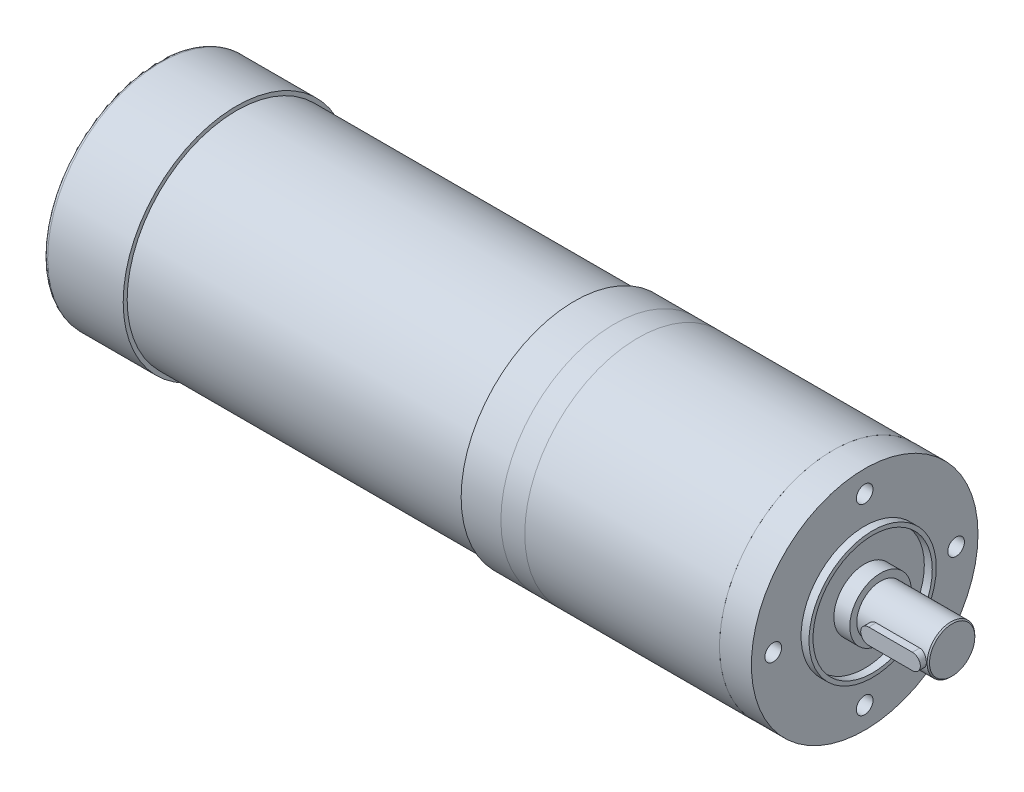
ISO-10303-21;
HEADER;
FILE_DESCRIPTION(('STEP AP214'),'2;1');
FILE_NAME('part.step','',(''),(''),'','','');
FILE_SCHEMA(('AUTOMOTIVE_DESIGN { 1 0 10303 214 1 1 1 1 }'));
ENDSEC;
DATA;
#1=APPLICATION_CONTEXT('core data for automotive mechanical design processes');
#2=APPLICATION_PROTOCOL_DEFINITION('international standard','automotive_design',2000,#1);
#3=PRODUCT_CONTEXT('',#1,'mechanical');
#4=PRODUCT('Part','Part','',(#3));
#5=PRODUCT_RELATED_PRODUCT_CATEGORY('part','',(#4));
#6=PRODUCT_DEFINITION_FORMATION('','',#4);
#7=PRODUCT_DEFINITION_CONTEXT('part definition',#1,'design');
#8=PRODUCT_DEFINITION('design','',#6,#7);
#9=PRODUCT_DEFINITION_SHAPE('','',#8);
#10=(LENGTH_UNIT() NAMED_UNIT(*) SI_UNIT(.MILLI.,.METRE.));
#11=(NAMED_UNIT(*) PLANE_ANGLE_UNIT() SI_UNIT($,.RADIAN.));
#12=(NAMED_UNIT(*) SI_UNIT($,.STERADIAN.) SOLID_ANGLE_UNIT());
#13=UNCERTAINTY_MEASURE_WITH_UNIT(LENGTH_MEASURE(1.E-05),#10,'distance_accuracy_value','');
#14=(GEOMETRIC_REPRESENTATION_CONTEXT(3) GLOBAL_UNCERTAINTY_ASSIGNED_CONTEXT((#13)) GLOBAL_UNIT_ASSIGNED_CONTEXT((#10,
#11,#12)) REPRESENTATION_CONTEXT('',''));
#15=CARTESIAN_POINT('',(0.,0.,0.));
#16=DIRECTION('',(0.,0.,1.));
#17=DIRECTION('',(1.,0.,0.));
#18=AXIS2_PLACEMENT_3D('',#15,#16,#17);
#19=CARTESIAN_POINT('',(8.5,0.,7.5));
#20=DIRECTION('',(0.,0.,-1.));
#21=DIRECTION('',(-1.,0.,0.));
#22=AXIS2_PLACEMENT_3D('',#19,#20,#21);
#23=CYLINDRICAL_SURFACE('',#22,2.);
#24=CARTESIAN_POINT('',(8.5,0.,3.5));
#25=DIRECTION('',(0.,0.,1.));
#26=DIRECTION('',(1.,0.,0.));
#27=AXIS2_PLACEMENT_3D('',#24,#25,#26);
#28=CIRCLE('',#27,2.);
#29=CARTESIAN_POINT('',(8.5,2.,3.5));
#30=VERTEX_POINT('',#29);
#31=CARTESIAN_POINT('',(8.5,-2.,3.5));
#32=VERTEX_POINT('',#31);
#33=EDGE_CURVE('E109',#30,#32,#28,.T.);
#34=ORIENTED_EDGE('',*,*,#33,.T.);
#35=DIRECTION('',(0.,0.,-1.));
#36=VECTOR('',#35,1.);
#37=CARTESIAN_POINT('',(8.5,-2.,7.5));
#38=LINE('',#37,#36);
#39=CARTESIAN_POINT('',(8.5,-2.,7.5));
#40=VERTEX_POINT('',#39);
#41=EDGE_CURVE('E12',#40,#32,#38,.T.);
#42=ORIENTED_EDGE('',*,*,#41,.F.);
#43=CARTESIAN_POINT('',(8.5,0.,7.5));
#44=DIRECTION('',(0.,0.,1.));
#45=DIRECTION('',(1.,0.,0.));
#46=AXIS2_PLACEMENT_3D('',#43,#44,#45);
#47=CIRCLE('',#46,2.);
#48=CARTESIAN_POINT('',(8.5,2.,7.5));
#49=VERTEX_POINT('',#48);
#50=EDGE_CURVE('E97',#49,#40,#47,.T.);
#51=ORIENTED_EDGE('',*,*,#50,.F.);
#52=DIRECTION('',(0.,0.,-1.));
#53=VECTOR('',#52,1.);
#54=CARTESIAN_POINT('',(8.5,2.,7.5));
#55=LINE('',#54,#53);
#56=EDGE_CURVE('E105',#49,#30,#55,.T.);
#57=ORIENTED_EDGE('',*,*,#56,.T.);
#58=EDGE_LOOP('',(#34,#42,#51,#57));
#59=FACE_BOUND('',#58,.T.);
#60=ADVANCED_FACE('F46',(#59),#23,.T.);
#61=CARTESIAN_POINT('',(19.5,-2.,7.5));
#62=DIRECTION('',(0.,1.,0.));
#63=DIRECTION('',(-1.,0.,0.));
#64=AXIS2_PLACEMENT_3D('',#61,#62,#63);
#65=PLANE('',#64);
#66=DIRECTION('',(1.,0.,0.));
#67=VECTOR('',#66,1.);
#68=CARTESIAN_POINT('',(19.5,-2.,3.5));
#69=LINE('',#68,#67);
#70=CARTESIAN_POINT('',(19.5,-2.,3.5));
#71=VERTEX_POINT('',#70);
#72=EDGE_CURVE('E101',#32,#71,#69,.T.);
#73=ORIENTED_EDGE('',*,*,#72,.T.);
#74=DIRECTION('',(0.,0.,-1.));
#75=VECTOR('',#74,1.);
#76=CARTESIAN_POINT('',(19.5,-2.,7.5));
#77=LINE('',#76,#75);
#78=CARTESIAN_POINT('',(19.5,-2.,7.5));
#79=VERTEX_POINT('',#78);
#80=EDGE_CURVE('E54',#79,#71,#77,.T.);
#81=ORIENTED_EDGE('',*,*,#80,.F.);
#82=DIRECTION('',(1.,0.,0.));
#83=VECTOR('',#82,1.);
#84=CARTESIAN_POINT('',(19.5,-2.,7.5));
#85=LINE('',#84,#83);
#86=EDGE_CURVE('E92',#40,#79,#85,.T.);
#87=ORIENTED_EDGE('',*,*,#86,.F.);
#88=ORIENTED_EDGE('',*,*,#41,.T.);
#89=EDGE_LOOP('',(#73,#81,#87,#88));
#90=FACE_BOUND('',#89,.T.);
#91=ADVANCED_FACE('F100',(#90),#65,.F.);
#92=CARTESIAN_POINT('',(19.5,0.,7.5));
#93=DIRECTION('',(0.,0.,-1.));
#94=DIRECTION('',(-1.,0.,0.));
#95=AXIS2_PLACEMENT_3D('',#92,#93,#94);
#96=CYLINDRICAL_SURFACE('',#95,2.);
#97=CARTESIAN_POINT('',(19.5,0.,3.5));
#98=DIRECTION('',(0.,0.,1.));
#99=DIRECTION('',(1.,0.,0.));
#100=AXIS2_PLACEMENT_3D('',#97,#98,#99);
#101=CIRCLE('',#100,2.);
#102=CARTESIAN_POINT('',(19.5,2.,3.5));
#103=VERTEX_POINT('',#102);
#104=EDGE_CURVE('E79',#71,#103,#101,.T.);
#105=ORIENTED_EDGE('',*,*,#104,.T.);
#106=DIRECTION('',(0.,0.,-1.));
#107=VECTOR('',#106,1.);
#108=CARTESIAN_POINT('',(19.5,2.,7.5));
#109=LINE('',#108,#107);
#110=CARTESIAN_POINT('',(19.5,2.,7.5));
#111=VERTEX_POINT('',#110);
#112=EDGE_CURVE('E102',#111,#103,#109,.T.);
#113=ORIENTED_EDGE('',*,*,#112,.F.);
#114=CARTESIAN_POINT('',(19.5,0.,7.5));
#115=DIRECTION('',(0.,0.,1.));
#116=DIRECTION('',(1.,0.,0.));
#117=AXIS2_PLACEMENT_3D('',#114,#115,#116);
#118=CIRCLE('',#117,2.);
#119=EDGE_CURVE('E95',#79,#111,#118,.T.);
#120=ORIENTED_EDGE('',*,*,#119,.F.);
#121=ORIENTED_EDGE('',*,*,#80,.T.);
#122=EDGE_LOOP('',(#105,#113,#120,#121));
#123=FACE_BOUND('',#122,.T.);
#124=ADVANCED_FACE('F103',(#123),#96,.T.);
#125=CARTESIAN_POINT('',(8.5,2.,7.5));
#126=DIRECTION('',(0.,-1.,0.));
#127=DIRECTION('',(1.,0.,0.));
#128=AXIS2_PLACEMENT_3D('',#125,#126,#127);
#129=PLANE('',#128);
#130=DIRECTION('',(-1.,0.,0.));
#131=VECTOR('',#130,1.);
#132=CARTESIAN_POINT('',(8.5,2.,3.5));
#133=LINE('',#132,#131);
#134=EDGE_CURVE('E85',#103,#30,#133,.T.);
#135=ORIENTED_EDGE('',*,*,#134,.T.);
#136=ORIENTED_EDGE('',*,*,#56,.F.);
#137=DIRECTION('',(-1.,0.,0.));
#138=VECTOR('',#137,1.);
#139=CARTESIAN_POINT('',(8.5,2.,7.5));
#140=LINE('',#139,#138);
#141=EDGE_CURVE('E62',#111,#49,#140,.T.);
#142=ORIENTED_EDGE('',*,*,#141,.F.);
#143=ORIENTED_EDGE('',*,*,#112,.T.);
#144=EDGE_LOOP('',(#135,#136,#142,#143));
#145=FACE_BOUND('',#144,.T.);
#146=ADVANCED_FACE('F116',(#145),#129,.F.);
#147=CARTESIAN_POINT('',(8.5,0.,7.5));
#148=DIRECTION('',(0.,0.,1.));
#149=DIRECTION('',(1.,0.,0.));
#150=AXIS2_PLACEMENT_3D('',#147,#148,#149);
#151=PLANE('',#150);
#152=ORIENTED_EDGE('',*,*,#50,.T.);
#153=ORIENTED_EDGE('',*,*,#86,.T.);
#154=ORIENTED_EDGE('',*,*,#119,.T.);
#155=ORIENTED_EDGE('',*,*,#141,.T.);
#156=EDGE_LOOP('',(#152,#153,#154,#155));
#157=FACE_BOUND('',#156,.T.);
#158=ADVANCED_FACE('F93',(#157),#151,.T.);
#159=CARTESIAN_POINT('',(8.5,0.,3.5));
#160=DIRECTION('',(0.,0.,1.));
#161=DIRECTION('',(1.,0.,0.));
#162=AXIS2_PLACEMENT_3D('',#159,#160,#161);
#163=PLANE('',#162);
#164=ORIENTED_EDGE('',*,*,#33,.F.);
#165=ORIENTED_EDGE('',*,*,#134,.F.);
#166=ORIENTED_EDGE('',*,*,#104,.F.);
#167=ORIENTED_EDGE('',*,*,#72,.F.);
#168=EDGE_LOOP('',(#164,#165,#166,#167));
#169=FACE_BOUND('',#168,.T.);
#170=ADVANCED_FACE('F119',(#169),#163,.F.);
#171=CLOSED_SHELL('',(#60,#91,#124,#146,#158,#170));
#172=MANIFOLD_SOLID_BREP('B2',#171);
#173=CARTESIAN_POINT('',(-73.,0.,0.));
#174=DIRECTION('',(-1.,0.,0.));
#175=DIRECTION('',(0.,0.,1.));
#176=AXIS2_PLACEMENT_3D('',#173,#174,#175);
#177=PLANE('',#176);
#178=CARTESIAN_POINT('',(-73.,0.,0.));
#179=DIRECTION('',(-1.,0.,0.));
#180=DIRECTION('',(0.,0.,1.));
#181=AXIS2_PLACEMENT_3D('',#178,#179,#180);
#182=CIRCLE('',#181,28.5);
#183=CARTESIAN_POINT('',(-73.,0.,28.5));
#184=VERTEX_POINT('',#183);
#185=EDGE_CURVE('E189',#184,#184,#182,.T.);
#186=ORIENTED_EDGE('',*,*,#185,.T.);
#187=EDGE_LOOP('',(#186));
#188=FACE_BOUND('',#187,.T.);
#189=CARTESIAN_POINT('',(-73.,0.,0.));
#190=DIRECTION('',(-1.,0.,0.));
#191=DIRECTION('',(0.,0.,1.));
#192=AXIS2_PLACEMENT_3D('',#189,#190,#191);
#193=CIRCLE('',#192,27.5);
#194=CARTESIAN_POINT('',(-73.,0.,27.5));
#195=VERTEX_POINT('',#194);
#196=EDGE_CURVE('E199',#195,#195,#193,.T.);
#197=ORIENTED_EDGE('',*,*,#196,.F.);
#198=EDGE_LOOP('',(#197));
#199=FACE_BOUND('',#198,.T.);
#200=ADVANCED_FACE('F178',(#188,#199),#177,.T.);
#201=CARTESIAN_POINT('',(-73.,0.,0.));
#202=DIRECTION('',(1.,0.,0.));
#203=DIRECTION('',(0.,0.,-1.));
#204=AXIS2_PLACEMENT_3D('',#201,#202,#203);
#205=CYLINDRICAL_SURFACE('',#204,28.5);
#206=ORIENTED_EDGE('',*,*,#185,.F.);
#207=EDGE_LOOP('',(#206));
#208=FACE_BOUND('',#207,.T.);
#209=CARTESIAN_POINT('',(-63.,0.,0.));
#210=DIRECTION('',(-1.,0.,0.));
#211=DIRECTION('',(0.,0.,1.));
#212=AXIS2_PLACEMENT_3D('',#209,#210,#211);
#213=CIRCLE('',#212,28.5);
#214=CARTESIAN_POINT('',(-63.,0.,28.5));
#215=VERTEX_POINT('',#214);
#216=EDGE_CURVE('E193',#215,#215,#213,.T.);
#217=ORIENTED_EDGE('',*,*,#216,.T.);
#218=EDGE_LOOP('',(#217));
#219=FACE_BOUND('',#218,.T.);
#220=ADVANCED_FACE('F224',(#208,#219),#205,.T.);
#221=CARTESIAN_POINT('',(-63.,0.,0.));
#222=DIRECTION('',(-1.,0.,0.));
#223=DIRECTION('',(0.,0.,1.));
#224=AXIS2_PLACEMENT_3D('',#221,#222,#223);
#225=PLANE('',#224);
#226=ORIENTED_EDGE('',*,*,#216,.F.);
#227=EDGE_LOOP('',(#226));
#228=FACE_BOUND('',#227,.T.);
#229=ADVANCED_FACE('F219',(#228),#225,.F.);
#230=CARTESIAN_POINT('',(-158.,0.,0.));
#231=DIRECTION('',(1.,0.,0.));
#232=DIRECTION('',(0.,0.,-1.));
#233=AXIS2_PLACEMENT_3D('',#230,#231,#232);
#234=CYLINDRICAL_SURFACE('',#233,27.5);
#235=CARTESIAN_POINT('',(-158.,0.,0.));
#236=DIRECTION('',(-1.,0.,0.));
#237=DIRECTION('',(0.,0.,1.));
#238=AXIS2_PLACEMENT_3D('',#235,#236,#237);
#239=CIRCLE('',#238,27.5);
#240=CARTESIAN_POINT('',(-158.,0.,27.5));
#241=VERTEX_POINT('',#240);
#242=EDGE_CURVE('E197',#241,#241,#239,.T.);
#243=ORIENTED_EDGE('',*,*,#242,.F.);
#244=EDGE_LOOP('',(#243));
#245=FACE_BOUND('',#244,.T.);
#246=ORIENTED_EDGE('',*,*,#196,.T.);
#247=EDGE_LOOP('',(#246));
#248=FACE_BOUND('',#247,.T.);
#249=ADVANCED_FACE('F213',(#245,#248),#234,.T.);
#250=CARTESIAN_POINT('',(-158.,0.,0.));
#251=DIRECTION('',(-1.,0.,0.));
#252=DIRECTION('',(0.,0.,1.));
#253=AXIS2_PLACEMENT_3D('',#250,#251,#252);
#254=PLANE('',#253);
#255=CARTESIAN_POINT('',(-158.,0.,0.));
#256=DIRECTION('',(-1.,0.,0.));
#257=DIRECTION('',(0.,0.,1.));
#258=AXIS2_PLACEMENT_3D('',#255,#256,#257);
#259=CIRCLE('',#258,28.5);
#260=CARTESIAN_POINT('',(-158.,0.,28.5));
#261=VERTEX_POINT('',#260);
#262=EDGE_CURVE('E202',#261,#261,#259,.T.);
#263=ORIENTED_EDGE('',*,*,#262,.F.);
#264=EDGE_LOOP('',(#263));
#265=FACE_BOUND('',#264,.T.);
#266=ORIENTED_EDGE('',*,*,#242,.T.);
#267=EDGE_LOOP('',(#266));
#268=FACE_BOUND('',#267,.T.);
#269=ADVANCED_FACE('F210',(#265,#268),#254,.F.);
#270=CARTESIAN_POINT('',(-178.,0.,0.));
#271=DIRECTION('',(1.,0.,0.));
#272=DIRECTION('',(0.,0.,-1.));
#273=AXIS2_PLACEMENT_3D('',#270,#271,#272);
#274=CYLINDRICAL_SURFACE('',#273,28.5);
#275=CARTESIAN_POINT('',(-177.,0.,0.));
#276=DIRECTION('',(-1.,0.,0.));
#277=DIRECTION('',(0.,0.,1.));
#278=AXIS2_PLACEMENT_3D('',#275,#276,#277);
#279=CIRCLE('',#278,28.5);
#280=CARTESIAN_POINT('',(-177.,0.,28.5));
#281=VERTEX_POINT('',#280);
#282=EDGE_CURVE('E45',#281,#281,#279,.F.);
#283=ORIENTED_EDGE('',*,*,#282,.T.);
#284=EDGE_LOOP('',(#283));
#285=FACE_BOUND('',#284,.T.);
#286=ORIENTED_EDGE('',*,*,#262,.T.);
#287=EDGE_LOOP('',(#286));
#288=FACE_BOUND('',#287,.T.);
#289=ADVANCED_FACE('F208',(#285,#288),#274,.T.);
#290=CARTESIAN_POINT('',(-178.,0.,0.));
#291=DIRECTION('',(-1.,0.,0.));
#292=DIRECTION('',(0.,0.,1.));
#293=AXIS2_PLACEMENT_3D('',#290,#291,#292);
#294=PLANE('',#293);
#295=CARTESIAN_POINT('',(-178.,0.,0.));
#296=DIRECTION('',(-1.,0.,0.));
#297=DIRECTION('',(0.,0.,1.));
#298=AXIS2_PLACEMENT_3D('',#295,#296,#297);
#299=CIRCLE('',#298,27.5);
#300=CARTESIAN_POINT('',(-178.,0.,27.5));
#301=VERTEX_POINT('',#300);
#302=EDGE_CURVE('E185',#301,#301,#299,.T.);
#303=ORIENTED_EDGE('',*,*,#302,.T.);
#304=EDGE_LOOP('',(#303));
#305=FACE_BOUND('',#304,.T.);
#306=ADVANCED_FACE('F255',(#305),#294,.T.);
#307=CARTESIAN_POINT('',(-177.,0.,0.));
#308=DIRECTION('',(-1.,0.,0.));
#309=DIRECTION('',(0.,0.,1.));
#310=AXIS2_PLACEMENT_3D('',#307,#308,#309);
#311=TOROIDAL_SURFACE('',#310,27.5,1.);
#312=ORIENTED_EDGE('',*,*,#282,.F.);
#313=EDGE_LOOP('',(#312));
#314=FACE_BOUND('',#313,.T.);
#315=ORIENTED_EDGE('',*,*,#302,.F.);
#316=EDGE_LOOP('',(#315));
#317=FACE_BOUND('',#316,.T.);
#318=ADVANCED_FACE('F180',(#314,#317),#311,.T.);
#319=CLOSED_SHELL('',(#200,#220,#229,#249,#269,#289,#306,#318));
#320=MANIFOLD_SOLID_BREP('B6',#319);
#321=CARTESIAN_POINT('',(-63.,0.,0.));
#322=DIRECTION('',(1.,0.,0.));
#323=DIRECTION('',(0.,0.,-1.));
#324=AXIS2_PLACEMENT_3D('',#321,#322,#323);
#325=CYLINDRICAL_SURFACE('',#324,28.5);
#326=CARTESIAN_POINT('',(-63.,0.,0.));
#327=DIRECTION('',(-1.,0.,0.));
#328=DIRECTION('',(0.,0.,1.));
#329=AXIS2_PLACEMENT_3D('',#326,#327,#328);
#330=CIRCLE('',#329,28.5);
#331=CARTESIAN_POINT('',(-63.,0.,28.5));
#332=VERTEX_POINT('',#331);
#333=EDGE_CURVE('E177',#332,#332,#330,.T.);
#334=ORIENTED_EDGE('',*,*,#333,.F.);
#335=EDGE_LOOP('',(#334));
#336=FACE_BOUND('',#335,.T.);
#337=CARTESIAN_POINT('',(-57.,0.,0.));
#338=DIRECTION('',(-1.,0.,0.));
#339=DIRECTION('',(0.,0.,1.));
#340=AXIS2_PLACEMENT_3D('',#337,#338,#339);
#341=CIRCLE('',#340,28.5);
#342=CARTESIAN_POINT('',(-57.,0.,28.5));
#343=VERTEX_POINT('',#342);
#344=EDGE_CURVE('E307',#343,#343,#341,.T.);
#345=ORIENTED_EDGE('',*,*,#344,.T.);
#346=EDGE_LOOP('',(#345));
#347=FACE_BOUND('',#346,.T.);
#348=ADVANCED_FACE('F304',(#336,#347),#325,.T.);
#349=CARTESIAN_POINT('',(-63.,0.,0.));
#350=DIRECTION('',(-1.,0.,0.));
#351=DIRECTION('',(0.,0.,1.));
#352=AXIS2_PLACEMENT_3D('',#349,#350,#351);
#353=PLANE('',#352);
#354=ORIENTED_EDGE('',*,*,#333,.T.);
#355=EDGE_LOOP('',(#354));
#356=FACE_BOUND('',#355,.T.);
#357=ADVANCED_FACE('F319',(#356),#353,.T.);
#358=CARTESIAN_POINT('',(-57.,0.,0.));
#359=DIRECTION('',(-1.,0.,0.));
#360=DIRECTION('',(0.,0.,1.));
#361=AXIS2_PLACEMENT_3D('',#358,#359,#360);
#362=PLANE('',#361);
#363=ORIENTED_EDGE('',*,*,#344,.F.);
#364=EDGE_LOOP('',(#363));
#365=FACE_BOUND('',#364,.T.);
#366=ADVANCED_FACE('F317',(#365),#362,.F.);
#367=CLOSED_SHELL('',(#348,#357,#366));
#368=MANIFOLD_SOLID_BREP('B40',#367);
#369=CARTESIAN_POINT('',(-57.,0.,0.));
#370=DIRECTION('',(1.,0.,0.));
#371=DIRECTION('',(0.,0.,-1.));
#372=AXIS2_PLACEMENT_3D('',#369,#370,#371);
#373=CYLINDRICAL_SURFACE('',#372,28.5);
#374=CARTESIAN_POINT('',(-57.,0.,0.));
#375=DIRECTION('',(-1.,0.,0.));
#376=DIRECTION('',(0.,0.,1.));
#377=AXIS2_PLACEMENT_3D('',#374,#375,#376);
#378=CIRCLE('',#377,28.5);
#379=CARTESIAN_POINT('',(-57.,0.,28.5));
#380=VERTEX_POINT('',#379);
#381=EDGE_CURVE('E302',#380,#380,#378,.T.);
#382=ORIENTED_EDGE('',*,*,#381,.F.);
#383=EDGE_LOOP('',(#382));
#384=FACE_BOUND('',#383,.T.);
#385=CARTESIAN_POINT('',(-8.,0.,0.));
#386=DIRECTION('',(-1.,0.,0.));
#387=DIRECTION('',(0.,0.,1.));
#388=AXIS2_PLACEMENT_3D('',#385,#386,#387);
#389=CIRCLE('',#388,28.5);
#390=CARTESIAN_POINT('',(-8.,0.,28.5));
#391=VERTEX_POINT('',#390);
#392=EDGE_CURVE('E362',#391,#391,#389,.T.);
#393=ORIENTED_EDGE('',*,*,#392,.T.);
#394=EDGE_LOOP('',(#393));
#395=FACE_BOUND('',#394,.T.);
#396=ADVANCED_FACE('F354',(#384,#395),#373,.T.);
#397=CARTESIAN_POINT('',(-57.,0.,0.));
#398=DIRECTION('',(-1.,0.,0.));
#399=DIRECTION('',(0.,0.,1.));
#400=AXIS2_PLACEMENT_3D('',#397,#398,#399);
#401=PLANE('',#400);
#402=ORIENTED_EDGE('',*,*,#381,.T.);
#403=EDGE_LOOP('',(#402));
#404=FACE_BOUND('',#403,.T.);
#405=ADVANCED_FACE('F427',(#404),#401,.T.);
#406=CARTESIAN_POINT('',(-8.,0.,0.));
#407=DIRECTION('',(-1.,0.,0.));
#408=DIRECTION('',(0.,0.,1.));
#409=AXIS2_PLACEMENT_3D('',#406,#407,#408);
#410=PLANE('',#409);
#411=CARTESIAN_POINT('',(-8.,23.,0.));
#412=DIRECTION('',(-1.,0.,0.));
#413=DIRECTION('',(0.,0.,1.));
#414=AXIS2_PLACEMENT_3D('',#411,#412,#413);
#415=CIRCLE('',#414,2.1);
#416=CARTESIAN_POINT('',(-8.,23.,2.1));
#417=VERTEX_POINT('',#416);
#418=EDGE_CURVE('E357',#417,#417,#415,.T.);
#419=ORIENTED_EDGE('',*,*,#418,.T.);
#420=EDGE_LOOP('',(#419));
#421=FACE_BOUND('',#420,.T.);
#422=CARTESIAN_POINT('',(-8.,0.,-23.));
#423=DIRECTION('',(-1.,0.,0.));
#424=DIRECTION('',(0.,0.,1.));
#425=AXIS2_PLACEMENT_3D('',#422,#423,#424);
#426=CIRCLE('',#425,2.1);
#427=CARTESIAN_POINT('',(-8.,0.,-20.9));
#428=VERTEX_POINT('',#427);
#429=EDGE_CURVE('E391',#428,#428,#426,.T.);
#430=ORIENTED_EDGE('',*,*,#429,.T.);
#431=EDGE_LOOP('',(#430));
#432=FACE_BOUND('',#431,.T.);
#433=CARTESIAN_POINT('',(-8.,-23.,0.));
#434=DIRECTION('',(-1.,0.,0.));
#435=DIRECTION('',(0.,0.,1.));
#436=AXIS2_PLACEMENT_3D('',#433,#434,#435);
#437=CIRCLE('',#436,2.1);
#438=CARTESIAN_POINT('',(-8.,-23.,2.1));
#439=VERTEX_POINT('',#438);
#440=EDGE_CURVE('E395',#439,#439,#437,.T.);
#441=ORIENTED_EDGE('',*,*,#440,.T.);
#442=EDGE_LOOP('',(#441));
#443=FACE_BOUND('',#442,.T.);
#444=CARTESIAN_POINT('',(-8.,0.,23.));
#445=DIRECTION('',(-1.,0.,0.));
#446=DIRECTION('',(0.,0.,1.));
#447=AXIS2_PLACEMENT_3D('',#444,#445,#446);
#448=CIRCLE('',#447,2.1);
#449=CARTESIAN_POINT('',(-8.,0.,25.1));
#450=VERTEX_POINT('',#449);
#451=EDGE_CURVE('E398',#450,#450,#448,.T.);
#452=ORIENTED_EDGE('',*,*,#451,.T.);
#453=EDGE_LOOP('',(#452));
#454=FACE_BOUND('',#453,.T.);
#455=ORIENTED_EDGE('',*,*,#392,.F.);
#456=EDGE_LOOP('',(#455));
#457=FACE_BOUND('',#456,.T.);
#458=ADVANCED_FACE('F408',(#421,#432,#443,#454,#457),#410,.F.);
#459=CARTESIAN_POINT('',(0.,0.,23.));
#460=DIRECTION('',(1.,0.,0.));
#461=DIRECTION('',(0.,0.,-1.));
#462=AXIS2_PLACEMENT_3D('',#459,#460,#461);
#463=CYLINDRICAL_SURFACE('',#462,2.1);
#464=CARTESIAN_POINT('',(-14.,0.,23.));
#465=DIRECTION('',(1.,0.,0.));
#466=DIRECTION('',(0.,0.,-1.));
#467=AXIS2_PLACEMENT_3D('',#464,#465,#466);
#468=CIRCLE('',#467,2.1);
#469=CARTESIAN_POINT('',(-14.,0.,20.9));
#470=VERTEX_POINT('',#469);
#471=EDGE_CURVE('E396',#470,#470,#468,.T.);
#472=ORIENTED_EDGE('',*,*,#471,.F.);
#473=EDGE_LOOP('',(#472));
#474=FACE_BOUND('',#473,.T.);
#475=ORIENTED_EDGE('',*,*,#451,.F.);
#476=EDGE_LOOP('',(#475));
#477=FACE_BOUND('',#476,.T.);
#478=ADVANCED_FACE('F439',(#474,#477),#463,.F.);
#479=CARTESIAN_POINT('',(-14.,0.,23.));
#480=DIRECTION('',(1.,0.,0.));
#481=DIRECTION('',(0.,0.,-1.));
#482=AXIS2_PLACEMENT_3D('',#479,#480,#481);
#483=CONICAL_SURFACE('',#482,2.1,1.02974425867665);
#484=CARTESIAN_POINT('',(-15.2618072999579,0.,23.));
#485=VERTEX_POINT('',#484);
#486=VERTEX_LOOP('',#485);
#487=FACE_BOUND('',#486,.T.);
#488=ORIENTED_EDGE('',*,*,#471,.T.);
#489=EDGE_LOOP('',(#488));
#490=FACE_BOUND('',#489,.T.);
#491=ADVANCED_FACE('F444',(#487,#490),#483,.F.);
#492=CARTESIAN_POINT('',(0.,-23.,0.));
#493=DIRECTION('',(1.,0.,0.));
#494=DIRECTION('',(0.,0.,-1.));
#495=AXIS2_PLACEMENT_3D('',#492,#493,#494);
#496=CYLINDRICAL_SURFACE('',#495,2.1);
#497=CARTESIAN_POINT('',(-14.,-23.,0.));
#498=DIRECTION('',(1.,0.,0.));
#499=DIRECTION('',(0.,0.,-1.));
#500=AXIS2_PLACEMENT_3D('',#497,#498,#499);
#501=CIRCLE('',#500,2.1);
#502=CARTESIAN_POINT('',(-14.,-23.,-2.1));
#503=VERTEX_POINT('',#502);
#504=EDGE_CURVE('E392',#503,#503,#501,.T.);
#505=ORIENTED_EDGE('',*,*,#504,.F.);
#506=EDGE_LOOP('',(#505));
#507=FACE_BOUND('',#506,.T.);
#508=ORIENTED_EDGE('',*,*,#440,.F.);
#509=EDGE_LOOP('',(#508));
#510=FACE_BOUND('',#509,.T.);
#511=ADVANCED_FACE('F423',(#507,#510),#496,.F.);
#512=CARTESIAN_POINT('',(-14.,-23.,0.));
#513=DIRECTION('',(1.,0.,0.));
#514=DIRECTION('',(0.,0.,-1.));
#515=AXIS2_PLACEMENT_3D('',#512,#513,#514);
#516=CONICAL_SURFACE('',#515,2.1,1.02974425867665);
#517=CARTESIAN_POINT('',(-15.2618072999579,-23.,0.));
#518=VERTEX_POINT('',#517);
#519=VERTEX_LOOP('',#518);
#520=FACE_BOUND('',#519,.T.);
#521=ORIENTED_EDGE('',*,*,#504,.T.);
#522=EDGE_LOOP('',(#521));
#523=FACE_BOUND('',#522,.T.);
#524=ADVANCED_FACE('F414',(#520,#523),#516,.F.);
#525=CARTESIAN_POINT('',(0.,0.,-23.));
#526=DIRECTION('',(1.,0.,0.));
#527=DIRECTION('',(0.,0.,-1.));
#528=AXIS2_PLACEMENT_3D('',#525,#526,#527);
#529=CYLINDRICAL_SURFACE('',#528,2.1);
#530=CARTESIAN_POINT('',(-14.,0.,-23.));
#531=DIRECTION('',(1.,0.,0.));
#532=DIRECTION('',(0.,0.,-1.));
#533=AXIS2_PLACEMENT_3D('',#530,#531,#532);
#534=CIRCLE('',#533,2.1);
#535=CARTESIAN_POINT('',(-14.,0.,-25.1));
#536=VERTEX_POINT('',#535);
#537=EDGE_CURVE('E387',#536,#536,#534,.T.);
#538=ORIENTED_EDGE('',*,*,#537,.F.);
#539=EDGE_LOOP('',(#538));
#540=FACE_BOUND('',#539,.T.);
#541=ORIENTED_EDGE('',*,*,#429,.F.);
#542=EDGE_LOOP('',(#541));
#543=FACE_BOUND('',#542,.T.);
#544=ADVANCED_FACE('F411',(#540,#543),#529,.F.);
#545=CARTESIAN_POINT('',(-14.,0.,-23.));
#546=DIRECTION('',(1.,0.,0.));
#547=DIRECTION('',(0.,0.,-1.));
#548=AXIS2_PLACEMENT_3D('',#545,#546,#547);
#549=CONICAL_SURFACE('',#548,2.1,1.02974425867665);
#550=CARTESIAN_POINT('',(-15.2618072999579,0.,-23.));
#551=VERTEX_POINT('',#550);
#552=VERTEX_LOOP('',#551);
#553=FACE_BOUND('',#552,.T.);
#554=ORIENTED_EDGE('',*,*,#537,.T.);
#555=EDGE_LOOP('',(#554));
#556=FACE_BOUND('',#555,.T.);
#557=ADVANCED_FACE('F413',(#553,#556),#549,.F.);
#558=CARTESIAN_POINT('',(0.,23.,0.));
#559=DIRECTION('',(1.,0.,0.));
#560=DIRECTION('',(0.,0.,-1.));
#561=AXIS2_PLACEMENT_3D('',#558,#559,#560);
#562=CYLINDRICAL_SURFACE('',#561,2.1);
#563=CARTESIAN_POINT('',(-14.,23.,0.));
#564=DIRECTION('',(1.,0.,0.));
#565=DIRECTION('',(0.,0.,-1.));
#566=AXIS2_PLACEMENT_3D('',#563,#564,#565);
#567=CIRCLE('',#566,2.1);
#568=CARTESIAN_POINT('',(-14.,23.,-2.1));
#569=VERTEX_POINT('',#568);
#570=EDGE_CURVE('E383',#569,#569,#567,.T.);
#571=ORIENTED_EDGE('',*,*,#570,.F.);
#572=EDGE_LOOP('',(#571));
#573=FACE_BOUND('',#572,.T.);
#574=ORIENTED_EDGE('',*,*,#418,.F.);
#575=EDGE_LOOP('',(#574));
#576=FACE_BOUND('',#575,.T.);
#577=ADVANCED_FACE('F379',(#573,#576),#562,.F.);
#578=CARTESIAN_POINT('',(-14.,23.,0.));
#579=DIRECTION('',(1.,0.,0.));
#580=DIRECTION('',(0.,0.,-1.));
#581=AXIS2_PLACEMENT_3D('',#578,#579,#580);
#582=CONICAL_SURFACE('',#581,2.1,1.02974425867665);
#583=CARTESIAN_POINT('',(-15.2618072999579,23.,0.));
#584=VERTEX_POINT('',#583);
#585=VERTEX_LOOP('',#584);
#586=FACE_BOUND('',#585,.T.);
#587=ORIENTED_EDGE('',*,*,#570,.T.);
#588=EDGE_LOOP('',(#587));
#589=FACE_BOUND('',#588,.T.);
#590=ADVANCED_FACE('F376',(#586,#589),#582,.F.);
#591=CLOSED_SHELL('',(#396,#405,#458,#478,#491,#511,#524,#544,#557,#577,#590));
#592=MANIFOLD_SOLID_BREP('B172',#591);
#593=CARTESIAN_POINT('',(4.,0.,0.));
#594=DIRECTION('',(1.,0.,0.));
#595=DIRECTION('',(0.,0.,-1.));
#596=AXIS2_PLACEMENT_3D('',#593,#594,#595);
#597=PLANE('',#596);
#598=CARTESIAN_POINT('',(4.,0.,0.));
#599=DIRECTION('',(1.,0.,0.));
#600=DIRECTION('',(0.,0.,-1.));
#601=AXIS2_PLACEMENT_3D('',#598,#599,#600);
#602=CIRCLE('',#601,7.75);
#603=CARTESIAN_POINT('',(4.,0.,-7.75));
#604=VERTEX_POINT('',#603);
#605=EDGE_CURVE('E640',#604,#604,#602,.T.);
#606=ORIENTED_EDGE('',*,*,#605,.T.);
#607=EDGE_LOOP('',(#606));
#608=FACE_BOUND('',#607,.T.);
#609=CARTESIAN_POINT('',(4.,0.,0.));
#610=DIRECTION('',(1.,0.,0.));
#611=DIRECTION('',(0.,0.,-1.));
#612=AXIS2_PLACEMENT_3D('',#609,#610,#611);
#613=CIRCLE('',#612,6.);
#614=CARTESIAN_POINT('',(4.,0.,-6.));
#615=VERTEX_POINT('',#614);
#616=EDGE_CURVE('E636',#615,#615,#613,.T.);
#617=ORIENTED_EDGE('',*,*,#616,.F.);
#618=EDGE_LOOP('',(#617));
#619=FACE_BOUND('',#618,.T.);
#620=ADVANCED_FACE('F545',(#608,#619),#597,.T.);
#621=CARTESIAN_POINT('',(0.,0.,0.));
#622=DIRECTION('',(1.,0.,0.));
#623=DIRECTION('',(0.,0.,-1.));
#624=AXIS2_PLACEMENT_3D('',#621,#622,#623);
#625=PLANE('',#624);
#626=CARTESIAN_POINT('',(0.,0.,0.));
#627=DIRECTION('',(1.,0.,0.));
#628=DIRECTION('',(0.,0.,-1.));
#629=AXIS2_PLACEMENT_3D('',#626,#627,#628);
#630=CIRCLE('',#629,15.);
#631=CARTESIAN_POINT('',(0.,0.,-15.));
#632=VERTEX_POINT('',#631);
#633=EDGE_CURVE('E658',#632,#632,#630,.F.);
#634=ORIENTED_EDGE('',*,*,#633,.F.);
#635=EDGE_LOOP('',(#634));
#636=FACE_BOUND('',#635,.T.);
#637=CARTESIAN_POINT('',(0.,0.,0.));
#638=DIRECTION('',(1.,0.,0.));
#639=DIRECTION('',(0.,0.,-1.));
#640=AXIS2_PLACEMENT_3D('',#637,#638,#639);
#641=CIRCLE('',#640,7.75);
#642=CARTESIAN_POINT('',(0.,0.,-7.75));
#643=VERTEX_POINT('',#642);
#644=EDGE_CURVE('E639',#643,#643,#641,.T.);
#645=ORIENTED_EDGE('',*,*,#644,.F.);
#646=EDGE_LOOP('',(#645));
#647=FACE_BOUND('',#646,.T.);
#648=ADVANCED_FACE('F721',(#636,#647),#625,.T.);
#649=CARTESIAN_POINT('',(0.,23.,0.));
#650=DIRECTION('',(1.,0.,0.));
#651=DIRECTION('',(0.,0.,-1.));
#652=AXIS2_PLACEMENT_3D('',#649,#650,#651);
#653=CIRCLE('',#652,2.1);
#654=CARTESIAN_POINT('',(0.,23.,-2.1));
#655=VERTEX_POINT('',#654);
#656=EDGE_CURVE('E613',#655,#655,#653,.T.);
#657=ORIENTED_EDGE('',*,*,#656,.F.);
#658=EDGE_LOOP('',(#657));
#659=FACE_BOUND('',#658,.T.);
#660=CARTESIAN_POINT('',(0.,0.,-23.));
#661=DIRECTION('',(1.,0.,0.));
#662=DIRECTION('',(0.,0.,-1.));
#663=AXIS2_PLACEMENT_3D('',#660,#661,#662);
#664=CIRCLE('',#663,2.1);
#665=CARTESIAN_POINT('',(0.,0.,-25.1));
#666=VERTEX_POINT('',#665);
#667=EDGE_CURVE('E620',#666,#666,#664,.T.);
#668=ORIENTED_EDGE('',*,*,#667,.F.);
#669=EDGE_LOOP('',(#668));
#670=FACE_BOUND('',#669,.T.);
#671=CARTESIAN_POINT('',(0.,-23.,0.));
#672=DIRECTION('',(1.,0.,0.));
#673=DIRECTION('',(0.,0.,-1.));
#674=AXIS2_PLACEMENT_3D('',#671,#672,#673);
#675=CIRCLE('',#674,2.1);
#676=CARTESIAN_POINT('',(0.,-23.,-2.1));
#677=VERTEX_POINT('',#676);
#678=EDGE_CURVE('E626',#677,#677,#675,.T.);
#679=ORIENTED_EDGE('',*,*,#678,.F.);
#680=EDGE_LOOP('',(#679));
#681=FACE_BOUND('',#680,.T.);
#682=CARTESIAN_POINT('',(0.,0.,23.));
#683=DIRECTION('',(1.,0.,0.));
#684=DIRECTION('',(0.,0.,-1.));
#685=AXIS2_PLACEMENT_3D('',#682,#683,#684);
#686=CIRCLE('',#685,2.1);
#687=CARTESIAN_POINT('',(0.,0.,20.9));
#688=VERTEX_POINT('',#687);
#689=EDGE_CURVE('E632',#688,#688,#686,.T.);
#690=ORIENTED_EDGE('',*,*,#689,.F.);
#691=EDGE_LOOP('',(#690));
#692=FACE_BOUND('',#691,.T.);
#693=CARTESIAN_POINT('',(0.,0.,0.));
#694=DIRECTION('',(1.,0.,0.));
#695=DIRECTION('',(0.,0.,-1.));
#696=AXIS2_PLACEMENT_3D('',#693,#694,#695);
#697=CIRCLE('',#696,28.5);
#698=CARTESIAN_POINT('',(0.,0.,-28.5));
#699=VERTEX_POINT('',#698);
#700=EDGE_CURVE('E652',#699,#699,#697,.T.);
#701=ORIENTED_EDGE('',*,*,#700,.T.);
#702=EDGE_LOOP('',(#701));
#703=FACE_BOUND('',#702,.T.);
#704=CARTESIAN_POINT('',(0.,0.,0.));
#705=DIRECTION('',(1.,0.,0.));
#706=DIRECTION('',(0.,0.,-1.));
#707=AXIS2_PLACEMENT_3D('',#704,#705,#706);
#708=CIRCLE('',#707,16.);
#709=CARTESIAN_POINT('',(0.,0.,-16.));
#710=VERTEX_POINT('',#709);
#711=EDGE_CURVE('E648',#710,#710,#708,.T.);
#712=ORIENTED_EDGE('',*,*,#711,.F.);
#713=EDGE_LOOP('',(#712));
#714=FACE_BOUND('',#713,.T.);
#715=ADVANCED_FACE('F726',(#659,#670,#681,#692,#703,#714),#625,.T.);
#716=CARTESIAN_POINT('',(-8.,0.,0.));
#717=DIRECTION('',(1.,0.,0.));
#718=DIRECTION('',(0.,0.,-1.));
#719=AXIS2_PLACEMENT_3D('',#716,#717,#718);
#720=CYLINDRICAL_SURFACE('',#719,28.5);
#721=CARTESIAN_POINT('',(-8.,0.,0.));
#722=DIRECTION('',(1.,0.,0.));
#723=DIRECTION('',(0.,0.,-1.));
#724=AXIS2_PLACEMENT_3D('',#721,#722,#723);
#725=CIRCLE('',#724,28.5);
#726=CARTESIAN_POINT('',(-8.,0.,-28.5));
#727=VERTEX_POINT('',#726);
#728=EDGE_CURVE('E655',#727,#727,#725,.T.);
#729=ORIENTED_EDGE('',*,*,#728,.T.);
#730=EDGE_LOOP('',(#729));
#731=FACE_BOUND('',#730,.T.);
#732=ORIENTED_EDGE('',*,*,#700,.F.);
#733=EDGE_LOOP('',(#732));
#734=FACE_BOUND('',#733,.T.);
#735=ADVANCED_FACE('F748',(#731,#734),#720,.T.);
#736=CARTESIAN_POINT('',(-8.,0.,0.));
#737=DIRECTION('',(1.,0.,0.));
#738=DIRECTION('',(0.,0.,-1.));
#739=AXIS2_PLACEMENT_3D('',#736,#737,#738);
#740=PLANE('',#739);
#741=CARTESIAN_POINT('',(-8.,23.,0.));
#742=DIRECTION('',(1.,0.,0.));
#743=DIRECTION('',(0.,0.,-1.));
#744=AXIS2_PLACEMENT_3D('',#741,#742,#743);
#745=CIRCLE('',#744,2.1);
#746=CARTESIAN_POINT('',(-8.,23.,-2.1));
#747=VERTEX_POINT('',#746);
#748=EDGE_CURVE('E619',#747,#747,#745,.T.);
#749=ORIENTED_EDGE('',*,*,#748,.T.);
#750=EDGE_LOOP('',(#749));
#751=FACE_BOUND('',#750,.T.);
#752=CARTESIAN_POINT('',(-8.,0.,-23.));
#753=DIRECTION('',(1.,0.,0.));
#754=DIRECTION('',(0.,0.,-1.));
#755=AXIS2_PLACEMENT_3D('',#752,#753,#754);
#756=CIRCLE('',#755,2.1);
#757=CARTESIAN_POINT('',(-8.,0.,-25.1));
#758=VERTEX_POINT('',#757);
#759=EDGE_CURVE('E623',#758,#758,#756,.T.);
#760=ORIENTED_EDGE('',*,*,#759,.T.);
#761=EDGE_LOOP('',(#760));
#762=FACE_BOUND('',#761,.T.);
#763=CARTESIAN_POINT('',(-8.,-23.,0.));
#764=DIRECTION('',(1.,0.,0.));
#765=DIRECTION('',(0.,0.,-1.));
#766=AXIS2_PLACEMENT_3D('',#763,#764,#765);
#767=CIRCLE('',#766,2.1);
#768=CARTESIAN_POINT('',(-8.,-23.,-2.1));
#769=VERTEX_POINT('',#768);
#770=EDGE_CURVE('E629',#769,#769,#767,.T.);
#771=ORIENTED_EDGE('',*,*,#770,.T.);
#772=EDGE_LOOP('',(#771));
#773=FACE_BOUND('',#772,.T.);
#774=CARTESIAN_POINT('',(-8.,0.,23.));
#775=DIRECTION('',(1.,0.,0.));
#776=DIRECTION('',(0.,0.,-1.));
#777=AXIS2_PLACEMENT_3D('',#774,#775,#776);
#778=CIRCLE('',#777,2.1);
#779=CARTESIAN_POINT('',(-8.,0.,20.9));
#780=VERTEX_POINT('',#779);
#781=EDGE_CURVE('E635',#780,#780,#778,.T.);
#782=ORIENTED_EDGE('',*,*,#781,.T.);
#783=EDGE_LOOP('',(#782));
#784=FACE_BOUND('',#783,.T.);
#785=ORIENTED_EDGE('',*,*,#728,.F.);
#786=EDGE_LOOP('',(#785));
#787=FACE_BOUND('',#786,.T.);
#788=ADVANCED_FACE('F742',(#751,#762,#773,#784,#787),#740,.F.);
#789=CARTESIAN_POINT('',(2.,0.,0.));
#790=DIRECTION('',(1.,0.,0.));
#791=DIRECTION('',(0.,0.,-1.));
#792=AXIS2_PLACEMENT_3D('',#789,#790,#791);
#793=PLANE('',#792);
#794=CARTESIAN_POINT('',(2.,0.,0.));
#795=DIRECTION('',(1.,0.,0.));
#796=DIRECTION('',(0.,0.,-1.));
#797=AXIS2_PLACEMENT_3D('',#794,#795,#796);
#798=CIRCLE('',#797,16.);
#799=CARTESIAN_POINT('',(2.,0.,-16.));
#800=VERTEX_POINT('',#799);
#801=EDGE_CURVE('E649',#800,#800,#798,.T.);
#802=ORIENTED_EDGE('',*,*,#801,.T.);
#803=EDGE_LOOP('',(#802));
#804=FACE_BOUND('',#803,.T.);
#805=CARTESIAN_POINT('',(2.,0.,0.));
#806=DIRECTION('',(1.,0.,0.));
#807=DIRECTION('',(0.,0.,-1.));
#808=AXIS2_PLACEMENT_3D('',#805,#806,#807);
#809=CIRCLE('',#808,15.);
#810=CARTESIAN_POINT('',(2.,0.,-15.));
#811=VERTEX_POINT('',#810);
#812=EDGE_CURVE('E643',#811,#811,#809,.T.);
#813=ORIENTED_EDGE('',*,*,#812,.F.);
#814=EDGE_LOOP('',(#813));
#815=FACE_BOUND('',#814,.T.);
#816=ADVANCED_FACE('F739',(#804,#815),#793,.T.);
#817=CARTESIAN_POINT('',(2.,0.,0.));
#818=DIRECTION('',(-1.,0.,0.));
#819=DIRECTION('',(0.,0.,1.));
#820=AXIS2_PLACEMENT_3D('',#817,#818,#819);
#821=CYLINDRICAL_SURFACE('',#820,16.);
#822=ORIENTED_EDGE('',*,*,#801,.F.);
#823=EDGE_LOOP('',(#822));
#824=FACE_BOUND('',#823,.T.);
#825=ORIENTED_EDGE('',*,*,#711,.T.);
#826=EDGE_LOOP('',(#825));
#827=FACE_BOUND('',#826,.T.);
#828=ADVANCED_FACE('F737',(#824,#827),#821,.T.);
#829=CARTESIAN_POINT('',(2.,0.,0.));
#830=DIRECTION('',(-1.,0.,0.));
#831=DIRECTION('',(0.,0.,1.));
#832=AXIS2_PLACEMENT_3D('',#829,#830,#831);
#833=CYLINDRICAL_SURFACE('',#832,15.);
#834=ORIENTED_EDGE('',*,*,#812,.T.);
#835=EDGE_LOOP('',(#834));
#836=FACE_BOUND('',#835,.T.);
#837=ORIENTED_EDGE('',*,*,#633,.T.);
#838=EDGE_LOOP('',(#837));
#839=FACE_BOUND('',#838,.T.);
#840=ADVANCED_FACE('F733',(#836,#839),#833,.F.);
#841=CARTESIAN_POINT('',(4.,0.,0.));
#842=DIRECTION('',(-1.,0.,0.));
#843=DIRECTION('',(0.,0.,1.));
#844=AXIS2_PLACEMENT_3D('',#841,#842,#843);
#845=CYLINDRICAL_SURFACE('',#844,7.75);
#846=ORIENTED_EDGE('',*,*,#605,.F.);
#847=EDGE_LOOP('',(#846));
#848=FACE_BOUND('',#847,.T.);
#849=ORIENTED_EDGE('',*,*,#644,.T.);
#850=EDGE_LOOP('',(#849));
#851=FACE_BOUND('',#850,.T.);
#852=ADVANCED_FACE('F717',(#848,#851),#845,.T.);
#853=CARTESIAN_POINT('',(22.,0.,0.));
#854=DIRECTION('',(-1.,0.,0.));
#855=DIRECTION('',(0.,0.,1.));
#856=AXIS2_PLACEMENT_3D('',#853,#854,#855);
#857=CYLINDRICAL_SURFACE('',#856,6.);
#858=CARTESIAN_POINT('',(21.7,0.,0.));
#859=DIRECTION('',(1.,0.,0.));
#860=DIRECTION('',(0.,0.,-1.));
#861=AXIS2_PLACEMENT_3D('',#858,#859,#860);
#862=CIRCLE('',#861,6.);
#863=CARTESIAN_POINT('',(21.7,0.,-6.));
#864=VERTEX_POINT('',#863);
#865=EDGE_CURVE('E352',#864,#864,#862,.F.);
#866=ORIENTED_EDGE('',*,*,#865,.T.);
#867=EDGE_LOOP('',(#866));
#868=FACE_BOUND('',#867,.T.);
#869=DIRECTION('',(-1.,0.,0.));
#870=VECTOR('',#869,1.);
#871=CARTESIAN_POINT('',(22.,2.,5.65685424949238));
#872=LINE('',#871,#870);
#873=CARTESIAN_POINT('',(8.5,2.,5.65685424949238));
#874=VERTEX_POINT('',#873);
#875=CARTESIAN_POINT('',(19.5,2.,5.65685424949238));
#876=VERTEX_POINT('',#875);
#877=EDGE_CURVE('E568',#874,#876,#872,.F.);
#878=ORIENTED_EDGE('',*,*,#877,.T.);
#879=CARTESIAN_POINT('',(19.5,2.,5.65685424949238));
#880=CARTESIAN_POINT('',(19.5545809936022,2.00000149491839,5.65684884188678));
#881=CARTESIAN_POINT('',(19.6091341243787,1.99776424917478,5.6576451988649));
#882=CARTESIAN_POINT('',(19.7178171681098,1.9888512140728,5.66078654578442));
#883=CARTESIAN_POINT('',(19.7719471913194,1.98217662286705,5.66313111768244));
#884=CARTESIAN_POINT('',(19.9327842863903,1.95562135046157,5.67238184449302));
#885=CARTESIAN_POINT('',(20.038361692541,1.92920846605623,5.6815058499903));
#886=CARTESIAN_POINT('',(20.2432503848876,1.85991682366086,5.70456149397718));
#887=CARTESIAN_POINT('',(20.3425650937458,1.81704715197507,5.71849047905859));
#888=CARTESIAN_POINT('',(20.5326796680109,1.71614645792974,5.74957574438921));
#889=CARTESIAN_POINT('',(20.6234742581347,1.65810612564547,5.76673400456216));
#890=CARTESIAN_POINT('',(20.7974404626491,1.52610278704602,5.80308960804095));
#891=CARTESIAN_POINT('',(20.8802297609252,1.45164996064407,5.82233755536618));
#892=CARTESIAN_POINT('',(21.0324120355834,1.28997688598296,5.86027697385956));
#893=CARTESIAN_POINT('',(21.1018026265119,1.20275436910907,5.87896834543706));
#894=CARTESIAN_POINT('',(21.2269590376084,1.01520729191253,5.91427765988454));
#895=CARTESIAN_POINT('',(21.2823219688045,0.914600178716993,5.93082875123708));
#896=CARTESIAN_POINT('',(21.3751845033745,0.704858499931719,5.95939217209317));
#897=CARTESIAN_POINT('',(21.4126895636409,0.595726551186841,5.97140588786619));
#898=CARTESIAN_POINT('',(21.4674714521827,0.376058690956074,5.98918142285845));
#899=CARTESIAN_POINT('',(21.4854065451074,0.265703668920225,5.99514617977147));
#900=CARTESIAN_POINT('',(21.5026325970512,0.0433979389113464,6.00087216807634));
#901=CARTESIAN_POINT('',(21.5019279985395,-0.0685523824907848,6.00063487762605));
#902=CARTESIAN_POINT('',(21.4823114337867,-0.286207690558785,5.99412077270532));
#903=CARTESIAN_POINT('',(21.4641147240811,-0.391985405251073,5.98808121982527));
#904=CARTESIAN_POINT('',(21.4112136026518,-0.598888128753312,5.97093921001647));
#905=CARTESIAN_POINT('',(21.3765082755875,-0.700012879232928,5.95983647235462));
#906=CARTESIAN_POINT('',(21.2911572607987,-0.896305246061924,5.93351336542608));
#907=CARTESIAN_POINT('',(21.2403079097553,-0.991377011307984,5.91824075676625));
#908=CARTESIAN_POINT('',(21.1242800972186,-1.17184917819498,5.88516775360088));
#909=CARTESIAN_POINT('',(21.059097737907,-1.25724693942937,5.86736667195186));
#910=CARTESIAN_POINT('',(20.9126579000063,-1.42019467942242,5.83012543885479));
#911=CARTESIAN_POINT('',(20.8307889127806,-1.4971872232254,5.81064757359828));
#912=CARTESIAN_POINT('',(20.6551170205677,-1.63654404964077,5.77294980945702));
#913=CARTESIAN_POINT('',(20.5613102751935,-1.69890360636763,5.75473031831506));
#914=CARTESIAN_POINT('',(20.3626396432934,-1.80800665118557,5.72140062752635));
#915=CARTESIAN_POINT('',(20.2576329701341,-1.85450601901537,5.70634029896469));
#916=CARTESIAN_POINT('',(20.0407060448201,-1.92892046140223,5.68162194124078));
#917=CARTESIAN_POINT('',(19.9287970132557,-1.95686487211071,5.67195538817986));
#918=CARTESIAN_POINT('',(19.763162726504,-1.98331631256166,5.6627308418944));
#919=CARTESIAN_POINT('',(19.7107172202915,-1.98957012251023,5.66053335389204));
#920=CARTESIAN_POINT('',(19.6055238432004,-1.99790923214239,5.65759407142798));
#921=CARTESIAN_POINT('',(19.5527764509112,-1.99999991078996,5.65685039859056));
#922=CARTESIAN_POINT('',(19.5,-2.,5.65685424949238));
#923=B_SPLINE_CURVE_WITH_KNOTS('',3,(#879,#880,#881,#882,#883,#884,#885,#886,#887,#888,#889,
#890,#891,#892,#893,#894,#895,#896,#897,#898,#899,#900,#901,#902,#903,#904,#905,#906,#907,#908,
#909,#910,#911,#912,#913,#914,#915,#916,#917,#918,#919,#920,#921,#922),.UNSPECIFIED.,.F.,.F.,(4,
2,2,2,2,2,2,2,2,2,2,2,2,2,2,2,2,2,2,2,2,4),(0.,0.163636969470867,0.327229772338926,
0.653162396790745,0.978915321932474,1.30486862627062,1.64233009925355,1.97985159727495,
2.32618265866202,2.67240782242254,3.00658941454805,3.34069136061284,3.6616883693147,
3.98270317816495,4.30794037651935,4.63326613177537,4.973881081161,5.31460588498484,
5.6603605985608,6.00556734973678,6.16399790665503,6.32222363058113),.UNSPECIFIED.);
#924=CARTESIAN_POINT('',(19.5,-2.,5.65685424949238));
#925=VERTEX_POINT('',#924);
#926=EDGE_CURVE('E663',#876,#925,#923,.T.);
#927=ORIENTED_EDGE('',*,*,#926,.T.);
#928=DIRECTION('',(-1.,0.,0.));
#929=VECTOR('',#928,1.);
#930=CARTESIAN_POINT('',(22.,-2.,5.65685424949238));
#931=LINE('',#930,#929);
#932=CARTESIAN_POINT('',(8.5,-2.,5.65685424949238));
#933=VERTEX_POINT('',#932);
#934=EDGE_CURVE('E891',#925,#933,#931,.T.);
#935=ORIENTED_EDGE('',*,*,#934,.T.);
#936=CARTESIAN_POINT('',(8.5,-2.,5.65685424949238));
#937=CARTESIAN_POINT('',(8.44541900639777,-2.0000014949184,5.65684884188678));
#938=CARTESIAN_POINT('',(8.39086587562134,-1.99776424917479,5.6576451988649));
#939=CARTESIAN_POINT('',(8.28218283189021,-1.9888512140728,5.66078654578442));
#940=CARTESIAN_POINT('',(8.22805280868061,-1.98217662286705,5.66313111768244));
#941=CARTESIAN_POINT('',(8.06721571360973,-1.95562135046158,5.67238184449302));
#942=CARTESIAN_POINT('',(7.96163830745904,-1.92920846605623,5.6815058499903));
#943=CARTESIAN_POINT('',(7.75674961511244,-1.85991682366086,5.70456149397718));
#944=CARTESIAN_POINT('',(7.65743490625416,-1.81704715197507,5.71849047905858));
#945=CARTESIAN_POINT('',(7.46732033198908,-1.71614645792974,5.74957574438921));
#946=CARTESIAN_POINT('',(7.37652574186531,-1.65810612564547,5.76673400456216));
#947=CARTESIAN_POINT('',(7.20255953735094,-1.52610278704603,5.80308960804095));
#948=CARTESIAN_POINT('',(7.11977023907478,-1.45164996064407,5.82233755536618));
#949=CARTESIAN_POINT('',(6.96758796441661,-1.28997688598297,5.86027697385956));
#950=CARTESIAN_POINT('',(6.89819737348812,-1.20275436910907,5.87896834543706));
#951=CARTESIAN_POINT('',(6.7730409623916,-1.01520729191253,5.91427765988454));
#952=CARTESIAN_POINT('',(6.71767803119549,-0.914600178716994,5.93082875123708));
#953=CARTESIAN_POINT('',(6.62481549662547,-0.704858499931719,5.95939217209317));
#954=CARTESIAN_POINT('',(6.58731043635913,-0.595726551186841,5.97140588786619));
#955=CARTESIAN_POINT('',(6.53252854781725,-0.376058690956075,5.98918142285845));
#956=CARTESIAN_POINT('',(6.51459345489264,-0.265703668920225,5.99514617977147));
#957=CARTESIAN_POINT('',(6.49736740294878,-0.0433979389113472,6.00087216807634));
#958=CARTESIAN_POINT('',(6.4980720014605,0.0685523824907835,6.00063487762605));
#959=CARTESIAN_POINT('',(6.51768856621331,0.286207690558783,5.99412077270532));
#960=CARTESIAN_POINT('',(6.53588527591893,0.391985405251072,5.98808121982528));
#961=CARTESIAN_POINT('',(6.58878639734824,0.598888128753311,5.97093921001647));
#962=CARTESIAN_POINT('',(6.62349172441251,0.700012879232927,5.95983647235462));
#963=CARTESIAN_POINT('',(6.70884273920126,0.896305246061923,5.93351336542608));
#964=CARTESIAN_POINT('',(6.75969209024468,0.991377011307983,5.91824075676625));
#965=CARTESIAN_POINT('',(6.8757199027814,1.17184917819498,5.88516775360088));
#966=CARTESIAN_POINT('',(6.94090226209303,1.25724693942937,5.86736667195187));
#967=CARTESIAN_POINT('',(7.08734209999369,1.42019467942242,5.83012543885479));
#968=CARTESIAN_POINT('',(7.16921108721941,1.4971872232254,5.81064757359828));
#969=CARTESIAN_POINT('',(7.34488297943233,1.63654404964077,5.77294980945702));
#970=CARTESIAN_POINT('',(7.43868972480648,1.69890360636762,5.75473031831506));
#971=CARTESIAN_POINT('',(7.63736035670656,1.80800665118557,5.72140062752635));
#972=CARTESIAN_POINT('',(7.74236702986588,1.85450601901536,5.70634029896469));
#973=CARTESIAN_POINT('',(7.95929395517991,1.92892046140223,5.68162194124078));
#974=CARTESIAN_POINT('',(8.0712029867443,1.95686487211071,5.67195538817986));
#975=CARTESIAN_POINT('',(8.23683727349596,1.98331631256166,5.6627308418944));
#976=CARTESIAN_POINT('',(8.28928277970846,1.98957012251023,5.66053335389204));
#977=CARTESIAN_POINT('',(8.39447615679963,1.99790923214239,5.65759407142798));
#978=CARTESIAN_POINT('',(8.44722354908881,1.99999991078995,5.65685039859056));
#979=CARTESIAN_POINT('',(8.5,2.,5.65685424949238));
#980=B_SPLINE_CURVE_WITH_KNOTS('',3,(#936,#937,#938,#939,#940,#941,#942,#943,#944,#945,#946,
#947,#948,#949,#950,#951,#952,#953,#954,#955,#956,#957,#958,#959,#960,#961,#962,#963,#964,#965,
#966,#967,#968,#969,#970,#971,#972,#973,#974,#975,#976,#977,#978,#979),.UNSPECIFIED.,.F.,.F.,(4,
2,2,2,2,2,2,2,2,2,2,2,2,2,2,2,2,2,2,2,2,4),(0.,0.163636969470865,0.327229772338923,
0.653162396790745,0.978915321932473,1.30486862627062,1.64233009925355,1.97985159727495,
2.32618265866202,2.67240782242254,3.00658941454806,3.34069136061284,3.6616883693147,
3.98270317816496,4.30794037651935,4.63326613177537,4.973881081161,5.31460588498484,
5.6603605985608,6.00556734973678,6.16399790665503,6.32222363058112),.UNSPECIFIED.);
#981=EDGE_CURVE('E560',#933,#874,#980,.T.);
#982=ORIENTED_EDGE('',*,*,#981,.T.);
#983=EDGE_LOOP('',(#878,#927,#935,#982));
#984=FACE_BOUND('',#983,.T.);
#985=ORIENTED_EDGE('',*,*,#616,.T.);
#986=EDGE_LOOP('',(#985));
#987=FACE_BOUND('',#986,.T.);
#988=ADVANCED_FACE('F680',(#868,#984,#987),#857,.T.);
#989=CARTESIAN_POINT('',(22.,0.,0.));
#990=DIRECTION('',(1.,0.,0.));
#991=DIRECTION('',(0.,0.,-1.));
#992=AXIS2_PLACEMENT_3D('',#989,#990,#991);
#993=PLANE('',#992);
#994=CARTESIAN_POINT('',(22.,0.,0.));
#995=DIRECTION('',(1.,0.,0.));
#996=DIRECTION('',(0.,0.,-1.));
#997=AXIS2_PLACEMENT_3D('',#994,#995,#996);
#998=CIRCLE('',#997,5.7);
#999=CARTESIAN_POINT('',(22.,0.,-5.7));
#1000=VERTEX_POINT('',#999);
#1001=EDGE_CURVE('E553',#1000,#1000,#998,.T.);
#1002=ORIENTED_EDGE('',*,*,#1001,.T.);
#1003=EDGE_LOOP('',(#1002));
#1004=FACE_BOUND('',#1003,.T.);
#1005=ADVANCED_FACE('F710',(#1004),#993,.T.);
#1006=CARTESIAN_POINT('',(0.,0.,23.));
#1007=DIRECTION('',(1.,0.,0.));
#1008=DIRECTION('',(0.,0.,-1.));
#1009=AXIS2_PLACEMENT_3D('',#1006,#1007,#1008);
#1010=CYLINDRICAL_SURFACE('',#1009,2.1);
#1011=ORIENTED_EDGE('',*,*,#689,.T.);
#1012=EDGE_LOOP('',(#1011));
#1013=FACE_BOUND('',#1012,.T.);
#1014=ORIENTED_EDGE('',*,*,#781,.F.);
#1015=EDGE_LOOP('',(#1014));
#1016=FACE_BOUND('',#1015,.T.);
#1017=ADVANCED_FACE('F707',(#1013,#1016),#1010,.F.);
#1018=CARTESIAN_POINT('',(0.,-23.,0.));
#1019=DIRECTION('',(1.,0.,0.));
#1020=DIRECTION('',(0.,0.,-1.));
#1021=AXIS2_PLACEMENT_3D('',#1018,#1019,#1020);
#1022=CYLINDRICAL_SURFACE('',#1021,2.1);
#1023=ORIENTED_EDGE('',*,*,#678,.T.);
#1024=EDGE_LOOP('',(#1023));
#1025=FACE_BOUND('',#1024,.T.);
#1026=ORIENTED_EDGE('',*,*,#770,.F.);
#1027=EDGE_LOOP('',(#1026));
#1028=FACE_BOUND('',#1027,.T.);
#1029=ADVANCED_FACE('F703',(#1025,#1028),#1022,.F.);
#1030=CARTESIAN_POINT('',(0.,0.,-23.));
#1031=DIRECTION('',(1.,0.,0.));
#1032=DIRECTION('',(0.,0.,-1.));
#1033=AXIS2_PLACEMENT_3D('',#1030,#1031,#1032);
#1034=CYLINDRICAL_SURFACE('',#1033,2.1);
#1035=ORIENTED_EDGE('',*,*,#667,.T.);
#1036=EDGE_LOOP('',(#1035));
#1037=FACE_BOUND('',#1036,.T.);
#1038=ORIENTED_EDGE('',*,*,#759,.F.);
#1039=EDGE_LOOP('',(#1038));
#1040=FACE_BOUND('',#1039,.T.);
#1041=ADVANCED_FACE('F699',(#1037,#1040),#1034,.F.);
#1042=CARTESIAN_POINT('',(0.,23.,0.));
#1043=DIRECTION('',(1.,0.,0.));
#1044=DIRECTION('',(0.,0.,-1.));
#1045=AXIS2_PLACEMENT_3D('',#1042,#1043,#1044);
#1046=CYLINDRICAL_SURFACE('',#1045,2.1);
#1047=ORIENTED_EDGE('',*,*,#656,.T.);
#1048=EDGE_LOOP('',(#1047));
#1049=FACE_BOUND('',#1048,.T.);
#1050=ORIENTED_EDGE('',*,*,#748,.F.);
#1051=EDGE_LOOP('',(#1050));
#1052=FACE_BOUND('',#1051,.T.);
#1053=ADVANCED_FACE('F696',(#1049,#1052),#1046,.F.);
#1054=CARTESIAN_POINT('',(8.5,0.,3.5));
#1055=DIRECTION('',(0.,0.,1.));
#1056=DIRECTION('',(1.,0.,0.));
#1057=AXIS2_PLACEMENT_3D('',#1054,#1055,#1056);
#1058=CYLINDRICAL_SURFACE('',#1057,2.);
#1059=DIRECTION('',(0.,0.,1.));
#1060=VECTOR('',#1059,1.);
#1061=CARTESIAN_POINT('',(8.5,-2.,3.5));
#1062=LINE('',#1061,#1060);
#1063=CARTESIAN_POINT('',(8.5,-2.,3.5));
#1064=VERTEX_POINT('',#1063);
#1065=EDGE_CURVE('E585',#1064,#933,#1062,.T.);
#1066=ORIENTED_EDGE('',*,*,#1065,.F.);
#1067=CARTESIAN_POINT('',(8.5,0.,3.5));
#1068=DIRECTION('',(0.,0.,1.));
#1069=DIRECTION('',(1.,0.,0.));
#1070=AXIS2_PLACEMENT_3D('',#1067,#1068,#1069);
#1071=CIRCLE('',#1070,2.);
#1072=CARTESIAN_POINT('',(8.5,2.,3.5));
#1073=VERTEX_POINT('',#1072);
#1074=EDGE_CURVE('E589',#1073,#1064,#1071,.T.);
#1075=ORIENTED_EDGE('',*,*,#1074,.F.);
#1076=DIRECTION('',(0.,0.,1.));
#1077=VECTOR('',#1076,1.);
#1078=CARTESIAN_POINT('',(8.5,2.,3.5));
#1079=LINE('',#1078,#1077);
#1080=EDGE_CURVE('E611',#1073,#874,#1079,.T.);
#1081=ORIENTED_EDGE('',*,*,#1080,.T.);
#1082=ORIENTED_EDGE('',*,*,#981,.F.);
#1083=EDGE_LOOP('',(#1066,#1075,#1081,#1082));
#1084=FACE_BOUND('',#1083,.T.);
#1085=ADVANCED_FACE('F587',(#1084),#1058,.F.);
#1086=CARTESIAN_POINT('',(8.5,2.,3.5));
#1087=DIRECTION('',(0.,1.,0.));
#1088=DIRECTION('',(-1.,0.,0.));
#1089=AXIS2_PLACEMENT_3D('',#1086,#1087,#1088);
#1090=PLANE('',#1089);
#1091=ORIENTED_EDGE('',*,*,#1080,.F.);
#1092=DIRECTION('',(-1.,0.,0.));
#1093=VECTOR('',#1092,1.);
#1094=CARTESIAN_POINT('',(8.5,2.,3.5));
#1095=LINE('',#1094,#1093);
#1096=CARTESIAN_POINT('',(19.5,2.,3.5));
#1097=VERTEX_POINT('',#1096);
#1098=EDGE_CURVE('E594',#1097,#1073,#1095,.T.);
#1099=ORIENTED_EDGE('',*,*,#1098,.F.);
#1100=DIRECTION('',(0.,0.,1.));
#1101=VECTOR('',#1100,1.);
#1102=CARTESIAN_POINT('',(19.5,2.,3.5));
#1103=LINE('',#1102,#1101);
#1104=EDGE_CURVE('E614',#1097,#876,#1103,.T.);
#1105=ORIENTED_EDGE('',*,*,#1104,.T.);
#1106=ORIENTED_EDGE('',*,*,#877,.F.);
#1107=EDGE_LOOP('',(#1091,#1099,#1105,#1106));
#1108=FACE_BOUND('',#1107,.T.);
#1109=ADVANCED_FACE('F689',(#1108),#1090,.F.);
#1110=CARTESIAN_POINT('',(19.5,0.,3.5));
#1111=DIRECTION('',(0.,0.,1.));
#1112=DIRECTION('',(1.,0.,0.));
#1113=AXIS2_PLACEMENT_3D('',#1110,#1111,#1112);
#1114=CYLINDRICAL_SURFACE('',#1113,2.);
#1115=ORIENTED_EDGE('',*,*,#1104,.F.);
#1116=CARTESIAN_POINT('',(19.5,0.,3.5));
#1117=DIRECTION('',(0.,0.,1.));
#1118=DIRECTION('',(1.,0.,0.));
#1119=AXIS2_PLACEMENT_3D('',#1116,#1117,#1118);
#1120=CIRCLE('',#1119,2.);
#1121=CARTESIAN_POINT('',(19.5,-2.,3.5));
#1122=VERTEX_POINT('',#1121);
#1123=EDGE_CURVE('E603',#1122,#1097,#1120,.T.);
#1124=ORIENTED_EDGE('',*,*,#1123,.F.);
#1125=DIRECTION('',(0.,0.,1.));
#1126=VECTOR('',#1125,1.);
#1127=CARTESIAN_POINT('',(19.5,-2.,3.5));
#1128=LINE('',#1127,#1126);
#1129=EDGE_CURVE('E593',#1122,#925,#1128,.T.);
#1130=ORIENTED_EDGE('',*,*,#1129,.T.);
#1131=ORIENTED_EDGE('',*,*,#926,.F.);
#1132=EDGE_LOOP('',(#1115,#1124,#1130,#1131));
#1133=FACE_BOUND('',#1132,.T.);
#1134=ADVANCED_FACE('F684',(#1133),#1114,.F.);
#1135=CARTESIAN_POINT('',(19.5,-2.,3.5));
#1136=DIRECTION('',(0.,-1.,0.));
#1137=DIRECTION('',(1.,0.,0.));
#1138=AXIS2_PLACEMENT_3D('',#1135,#1136,#1137);
#1139=PLANE('',#1138);
#1140=ORIENTED_EDGE('',*,*,#1129,.F.);
#1141=DIRECTION('',(1.,0.,0.));
#1142=VECTOR('',#1141,1.);
#1143=CARTESIAN_POINT('',(19.5,-2.,3.5));
#1144=LINE('',#1143,#1142);
#1145=EDGE_CURVE('E597',#1064,#1122,#1144,.T.);
#1146=ORIENTED_EDGE('',*,*,#1145,.F.);
#1147=ORIENTED_EDGE('',*,*,#1065,.T.);
#1148=ORIENTED_EDGE('',*,*,#934,.F.);
#1149=EDGE_LOOP('',(#1140,#1146,#1147,#1148));
#1150=FACE_BOUND('',#1149,.T.);
#1151=ADVANCED_FACE('F598',(#1150),#1139,.F.);
#1152=CARTESIAN_POINT('',(8.5,0.,3.5));
#1153=DIRECTION('',(0.,0.,1.));
#1154=DIRECTION('',(1.,0.,0.));
#1155=AXIS2_PLACEMENT_3D('',#1152,#1153,#1154);
#1156=PLANE('',#1155);
#1157=ORIENTED_EDGE('',*,*,#1074,.T.);
#1158=ORIENTED_EDGE('',*,*,#1145,.T.);
#1159=ORIENTED_EDGE('',*,*,#1123,.T.);
#1160=ORIENTED_EDGE('',*,*,#1098,.T.);
#1161=EDGE_LOOP('',(#1157,#1158,#1159,#1160));
#1162=FACE_BOUND('',#1161,.T.);
#1163=ADVANCED_FACE('F605',(#1162),#1156,.T.);
#1164=CARTESIAN_POINT('',(22.,0.,0.));
#1165=DIRECTION('',(-1.,0.,0.));
#1166=DIRECTION('',(0.,0.,1.));
#1167=AXIS2_PLACEMENT_3D('',#1164,#1165,#1166);
#1168=CONICAL_SURFACE('',#1167,5.7,0.785398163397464);
#1169=ORIENTED_EDGE('',*,*,#865,.F.);
#1170=EDGE_LOOP('',(#1169));
#1171=FACE_BOUND('',#1170,.T.);
#1172=ORIENTED_EDGE('',*,*,#1001,.F.);
#1173=EDGE_LOOP('',(#1172));
#1174=FACE_BOUND('',#1173,.T.);
#1175=ADVANCED_FACE('F547',(#1171,#1174),#1168,.T.);
#1176=CLOSED_SHELL('',(#620,#648,#715,#735,#788,#816,#828,#840,#852,#988,#1005,#1017,#1029,
#1041,#1053,#1085,#1109,#1134,#1151,#1163,#1175));
#1177=MANIFOLD_SOLID_BREP('B296',#1176);
#1178=ADVANCED_BREP_SHAPE_REPRESENTATION('',(#18,#172,#320,#368,#592,#1177),#14);
#1179=SHAPE_DEFINITION_REPRESENTATION(#9,#1178);
ENDSEC;
END-ISO-10303-21;
